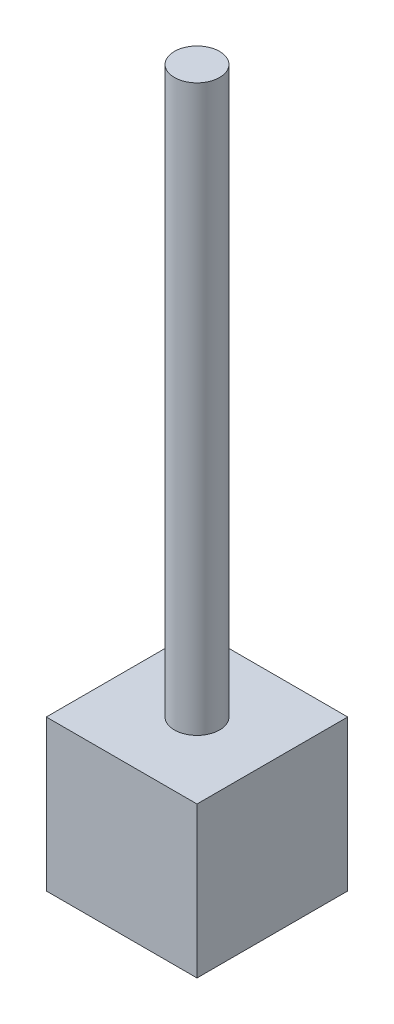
from build123d import *

# Parameters (mm, degrees)
ESQUISSE1_W      = 40
ESQUISSE1_H      = 40
EXTRUSION1_DEPTH = 40
ESQUISSE2_R      = 6
EXTRUSION2_DEPTH = 150


with BuildPart() as part:
    # Esquisse1 → Extrusion1 (new body)
    with BuildSketch(Plane.XY):
        with Locations((20, 20)):
            Rectangle(ESQUISSE1_W, ESQUISSE1_H)
    extrude(amount=EXTRUSION1_DEPTH)

    # Esquisse2 → Extrusion2 (add)
    with BuildSketch(Plane(origin=(0, 40, 0), x_dir=(-1, 0, 0), z_dir=(0, 1, 0))):
        with Locations(Location((-20, 20, 0), (0, 0, 270))):
            Circle(ESQUISSE2_R)
    extrude(amount=EXTRUSION2_DEPTH)


solid = part.part
